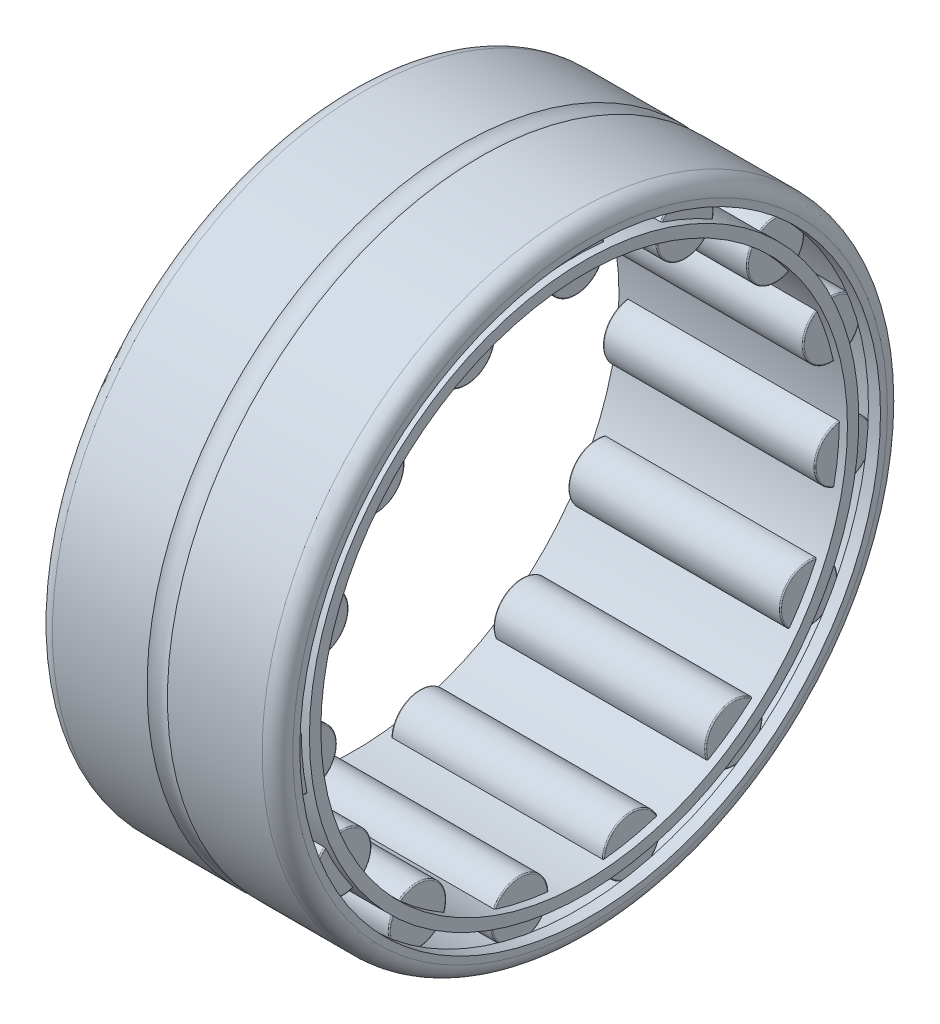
from build123d import *

# Parameters (mm, degrees)
CAGSPISKE_W           = 30.1625
CAGSPISKE_H           = 1.50642
ROLLERSDETAILED_COUNT = 15
ROLLERSDETAILED_ANGLE = 336


with BuildPart() as part:
    # InnRacSke → Race (revolve)
    with BuildSketch(Plane.XY, mode=Mode.PRIVATE) as race_sk:
        with BuildLine():
            Line((-14.2875, 38.3286), (-15.875, 38.3286))
            Line((-15.875, 38.3286), (-15.875, 39.243))
            ThreePointArc((-15.875, 39.243), (-15.279840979, 40.679840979), (-13.843, 41.275))
            Line((-13.843, 41.275), (-1.344041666, 41.275))
            ThreePointArc((-1.344041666, 41.275), (0, 40.767), (1.344041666, 41.275))
            Line((1.344041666, 41.275), (13.843, 41.275))
            ThreePointArc((13.843, 41.275), (15.279840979, 40.679840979), (15.875, 39.243))
            Line((15.875, 39.243), (15.875, 38.3286))
            Line((15.875, 38.3286), (14.2875, 38.3286))
            Line((14.2875, 38.3286), (14.2875, 39.2811))
            Line((14.2875, 39.2811), (-14.2875, 39.2811))
            Line((-14.2875, 39.2811), (-14.2875, 38.3286))
        make_face()
    revolve(race_sk.sketch.rotate(Axis((-31.75, 0, 0), (1, 0, 0)), 270), axis=Axis((-31.75, 0, 0), (1, 0, 0)))

    # RolDetSke → RollerDetailed (revolve)
    with BuildSketch(Plane.XY, mode=Mode.PRIVATE) as rollerdetailed_sk:
        with BuildLine():
            Line((-14.00175, 39.130958), (-14.00175, 35.51555))
            Line((-14.00175, 35.51555), (14.00175, 35.51555))
            Line((14.00175, 35.51555), (14.00175, 39.130958))
            ThreePointArc((14.00175, 39.130958), (13.95762798, 39.23747798), (13.851108, 39.2816))
            Line((13.851108, 39.2816), (-13.851108, 39.2816))
            ThreePointArc((-13.851108, 39.2816), (-13.95762798, 39.23747798), (-14.00175, 39.130958))
        make_face()
    rollerdetailed = revolve(rollerdetailed_sk.sketch.rotate(Axis((-28.575, 35.51555, 0), (1, 0, 0)), 270), axis=Axis((-28.575, 35.51555, 0), (1, 0, 0)))

    # CagSpiSke → CageSpine (revolve)
    with BuildSketch(Plane.XY, mode=Mode.PRIVATE) as cagespine_sk:
        with Locations((0, 35.51555)):
            Rectangle(CAGSPISKE_W, CAGSPISKE_H)
    revolve(cagespine_sk.sketch.rotate(Axis((-31.75, 0, 0), (1, 0, 0)), 90), axis=Axis((-31.75, 0, 0), (1, 0, 0)))

    # RollersDetailed: RollerDetailed ×15 about axis
    rollersdetailed_axis = Axis((-50, 0, 0), (1, 0, 0))
    for i in range(1, ROLLERSDETAILED_COUNT):
        add(rollerdetailed.rotate(rollersdetailed_axis, i * ROLLERSDETAILED_ANGLE / (ROLLERSDETAILED_COUNT - 1)))


solid = part.part
